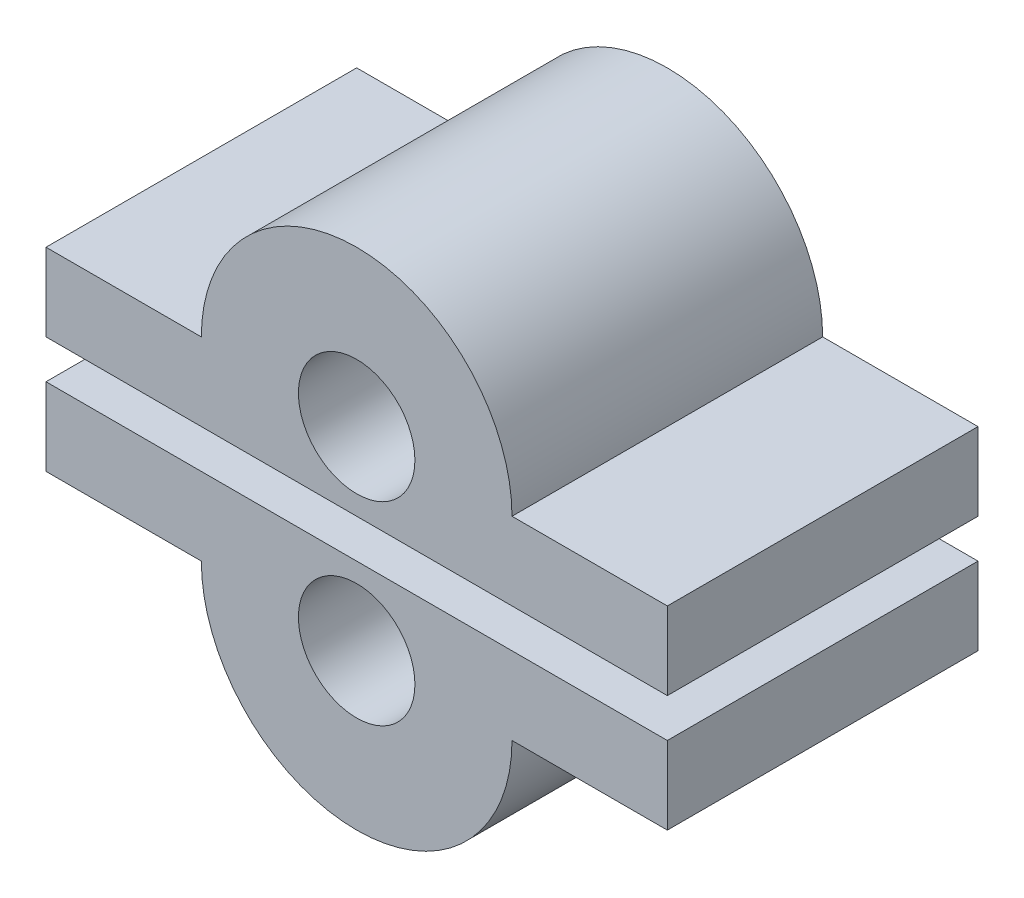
from build123d import *

# Parameters (mm, degrees)
SKETCH1_R          = 7.5
EXTRUDE1_DEPTH     = 20
SKETCH2_W          = 80
SKETCH2_H          = 5
CUT_EXTRUDE1_DEPTH = 20


with BuildPart() as part:
    # Sketch1 → Extrude1 (new, symmetric)
    with BuildSketch(Plane.XY):
        with BuildLine():
            Line((80, -12.5), (80, 12.5))
            Line((80, 12.5), (60, 12.5))
            ThreePointArc((60, 12.5), (40, 32.5), (20, 12.5))
            Line((20, 12.5), (0, 12.5))
            Line((0, 12.5), (0, -12.5))
            Line((0, -12.5), (20, -12.5))
            ThreePointArc((20, -12.5), (40, -32.5), (60, -12.5))
            Line((60, -12.5), (80, -12.5))
        make_face()
        with Locations((40, 12.5)):
            Circle(SKETCH1_R, mode=Mode.SUBTRACT)
        with Locations((40, -12.5)):
            Circle(SKETCH1_R, mode=Mode.SUBTRACT)
    extrude(amount=EXTRUDE1_DEPTH, both=True)

    # Sketch2 → Cut-Extrude1 (cut, symmetric)
    with BuildSketch(Plane.XY):
        with Locations((40, 0)):
            Rectangle(SKETCH2_W, SKETCH2_H)
    extrude(amount=CUT_EXTRUDE1_DEPTH, both=True, mode=Mode.SUBTRACT)


with BuildPart() as cut_extrude1_piece_1:
    # of the separate pieces the step leaves, piece 1, a body of its own (cut_extrude1_pieces)
    add(part.part.solids().sort_by_distance((60, -12.5, -20))[0])


with BuildPart() as cut_extrude1_piece_2:
    # of the separate pieces the step leaves, piece 2, a body of its own (cut_extrude1_pieces)
    add(part.part.solids().sort_by_distance((0, 2.5, -20))[0])


solid = Compound([cut_extrude1_piece_1.part, cut_extrude1_piece_2.part])
